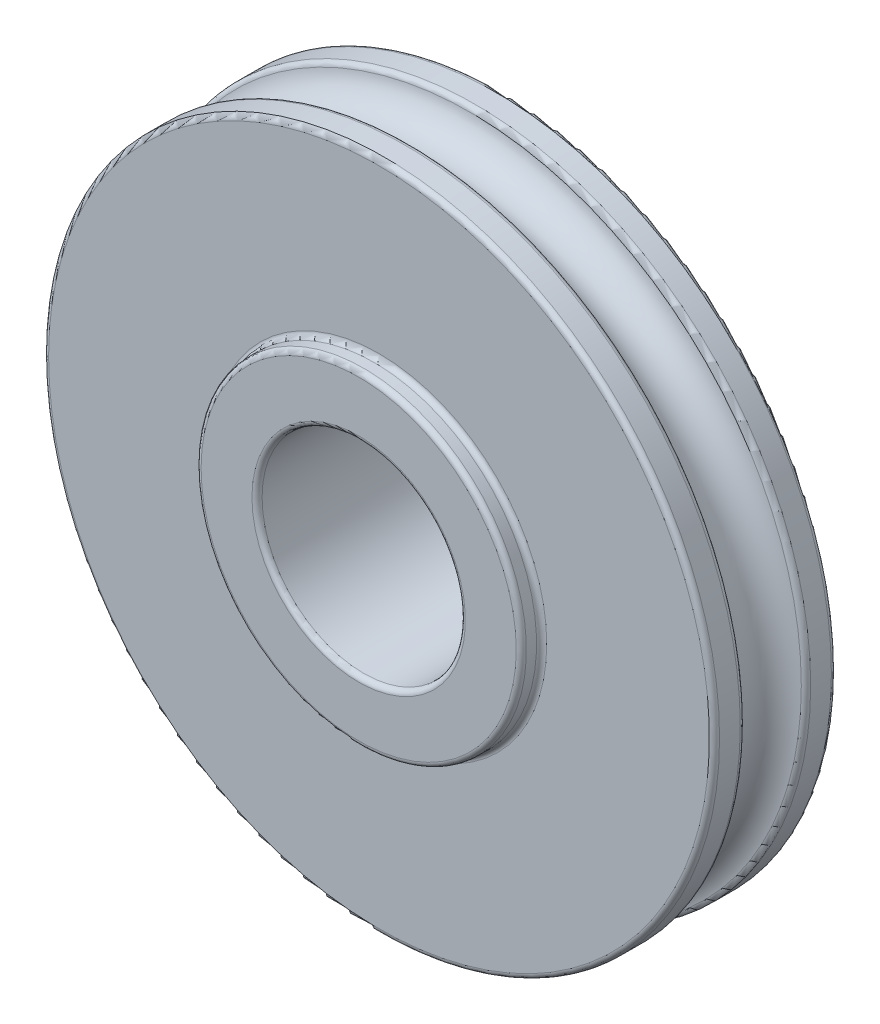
ISO-10303-21;
HEADER;
FILE_DESCRIPTION(('STEP AP214'),'2;1');
FILE_NAME('part.step','',(''),(''),'','','');
FILE_SCHEMA(('AUTOMOTIVE_DESIGN { 1 0 10303 214 1 1 1 1 }'));
ENDSEC;
DATA;
#1=APPLICATION_CONTEXT('core data for automotive mechanical design processes');
#2=APPLICATION_PROTOCOL_DEFINITION('international standard','automotive_design',2000,#1);
#3=PRODUCT_CONTEXT('',#1,'mechanical');
#4=PRODUCT('Part','Part','',(#3));
#5=PRODUCT_RELATED_PRODUCT_CATEGORY('part','',(#4));
#6=PRODUCT_DEFINITION_FORMATION('','',#4);
#7=PRODUCT_DEFINITION_CONTEXT('part definition',#1,'design');
#8=PRODUCT_DEFINITION('design','',#6,#7);
#9=PRODUCT_DEFINITION_SHAPE('','',#8);
#10=(LENGTH_UNIT() NAMED_UNIT(*) SI_UNIT(.MILLI.,.METRE.));
#11=(NAMED_UNIT(*) PLANE_ANGLE_UNIT() SI_UNIT($,.RADIAN.));
#12=(NAMED_UNIT(*) SI_UNIT($,.STERADIAN.) SOLID_ANGLE_UNIT());
#13=UNCERTAINTY_MEASURE_WITH_UNIT(LENGTH_MEASURE(1.E-05),#10,'distance_accuracy_value','');
#14=(GEOMETRIC_REPRESENTATION_CONTEXT(3) GLOBAL_UNCERTAINTY_ASSIGNED_CONTEXT((#13)) GLOBAL_UNIT_ASSIGNED_CONTEXT((#10,
#11,#12)) REPRESENTATION_CONTEXT('',''));
#15=CARTESIAN_POINT('',(0.,0.,0.));
#16=DIRECTION('',(0.,0.,1.));
#17=DIRECTION('',(1.,0.,0.));
#18=AXIS2_PLACEMENT_3D('',#15,#16,#17);
#19=CARTESIAN_POINT('',(0.,0.,0.));
#20=DIRECTION('',(0.,0.,1.));
#21=DIRECTION('',(1.,0.,0.));
#22=AXIS2_PLACEMENT_3D('',#19,#20,#21);
#23=TOROIDAL_SURFACE('',#22,16.5,1.5);
#24=CARTESIAN_POINT('',(0.,0.,-1.48461497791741));
#25=DIRECTION('',(0.,0.,1.));
#26=DIRECTION('',(1.,0.,0.));
#27=AXIS2_PLACEMENT_3D('',#24,#25,#26);
#28=CIRCLE('',#27,16.2857142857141);
#29=CARTESIAN_POINT('',(16.2857142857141,0.,-1.48461497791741));
#30=VERTEX_POINT('',#29);
#31=EDGE_CURVE('E67',#30,#30,#28,.T.);
#32=ORIENTED_EDGE('',*,*,#31,.T.);
#33=EDGE_LOOP('',(#32));
#34=FACE_BOUND('',#33,.T.);
#35=CARTESIAN_POINT('',(0.,0.,1.48461497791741));
#36=DIRECTION('',(0.,0.,-1.));
#37=DIRECTION('',(-1.,0.,0.));
#38=AXIS2_PLACEMENT_3D('',#35,#36,#37);
#39=CIRCLE('',#38,16.2857142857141);
#40=CARTESIAN_POINT('',(-16.2857142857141,0.,1.48461497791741));
#41=VERTEX_POINT('',#40);
#42=EDGE_CURVE('E70',#41,#41,#39,.T.);
#43=ORIENTED_EDGE('',*,*,#42,.T.);
#44=EDGE_LOOP('',(#43));
#45=FACE_BOUND('',#44,.T.);
#46=ADVANCED_FACE('F29',(#34,#45),#23,.F.);
#47=CARTESIAN_POINT('',(0.,0.,4.));
#48=DIRECTION('',(0.,0.,1.));
#49=DIRECTION('',(1.,0.,0.));
#50=AXIS2_PLACEMENT_3D('',#47,#48,#49);
#51=CYLINDRICAL_SURFACE('',#50,16.5);
#52=CARTESIAN_POINT('',(0.,0.,1.73205080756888));
#53=DIRECTION('',(0.,0.,-1.));
#54=DIRECTION('',(-1.,0.,0.));
#55=AXIS2_PLACEMENT_3D('',#52,#53,#54);
#56=CIRCLE('',#55,16.5);
#57=CARTESIAN_POINT('',(-16.5,0.,1.73205080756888));
#58=VERTEX_POINT('',#57);
#59=EDGE_CURVE('E61',#58,#58,#56,.F.);
#60=ORIENTED_EDGE('',*,*,#59,.T.);
#61=EDGE_LOOP('',(#60));
#62=FACE_BOUND('',#61,.T.);
#63=CARTESIAN_POINT('',(0.,0.,2.75));
#64=DIRECTION('',(0.,0.,-1.));
#65=DIRECTION('',(-1.,0.,0.));
#66=AXIS2_PLACEMENT_3D('',#63,#64,#65);
#67=CIRCLE('',#66,16.5);
#68=CARTESIAN_POINT('',(-16.5,0.,2.75));
#69=VERTEX_POINT('',#68);
#70=EDGE_CURVE('E64',#69,#69,#67,.T.);
#71=ORIENTED_EDGE('',*,*,#70,.T.);
#72=EDGE_LOOP('',(#71));
#73=FACE_BOUND('',#72,.T.);
#74=ADVANCED_FACE('F134',(#62,#73),#51,.T.);
#75=CARTESIAN_POINT('',(0.,16.5,3.));
#76=DIRECTION('',(0.,0.,-1.));
#77=DIRECTION('',(-1.,0.,0.));
#78=AXIS2_PLACEMENT_3D('',#75,#76,#77);
#79=PLANE('',#78);
#80=CARTESIAN_POINT('',(0.,0.,3.));
#81=DIRECTION('',(0.,0.,-1.));
#82=DIRECTION('',(-1.,0.,0.));
#83=AXIS2_PLACEMENT_3D('',#80,#81,#82);
#84=CIRCLE('',#83,16.25);
#85=CARTESIAN_POINT('',(-16.25,0.,3.));
#86=VERTEX_POINT('',#85);
#87=EDGE_CURVE('E55',#86,#86,#84,.F.);
#88=ORIENTED_EDGE('',*,*,#87,.T.);
#89=EDGE_LOOP('',(#88));
#90=FACE_BOUND('',#89,.T.);
#91=CARTESIAN_POINT('',(0.,0.,3.));
#92=DIRECTION('',(0.,0.,-1.));
#93=DIRECTION('',(-1.,0.,0.));
#94=AXIS2_PLACEMENT_3D('',#91,#92,#93);
#95=CIRCLE('',#94,8.25);
#96=CARTESIAN_POINT('',(-8.25,0.,3.));
#97=VERTEX_POINT('',#96);
#98=EDGE_CURVE('E58',#97,#97,#95,.T.);
#99=ORIENTED_EDGE('',*,*,#98,.T.);
#100=EDGE_LOOP('',(#99));
#101=FACE_BOUND('',#100,.T.);
#102=ADVANCED_FACE('F146',(#90,#101),#79,.F.);
#103=CARTESIAN_POINT('',(0.,0.,4.));
#104=DIRECTION('',(0.,0.,1.));
#105=DIRECTION('',(1.,0.,0.));
#106=AXIS2_PLACEMENT_3D('',#103,#104,#105);
#107=CYLINDRICAL_SURFACE('',#106,8.);
#108=CARTESIAN_POINT('',(0.,0.,3.25));
#109=DIRECTION('',(0.,0.,-1.));
#110=DIRECTION('',(-1.,0.,0.));
#111=AXIS2_PLACEMENT_3D('',#108,#109,#110);
#112=CIRCLE('',#111,8.);
#113=CARTESIAN_POINT('',(-8.,0.,3.25));
#114=VERTEX_POINT('',#113);
#115=EDGE_CURVE('E49',#114,#114,#112,.F.);
#116=ORIENTED_EDGE('',*,*,#115,.T.);
#117=EDGE_LOOP('',(#116));
#118=FACE_BOUND('',#117,.T.);
#119=CARTESIAN_POINT('',(0.,0.,3.75));
#120=DIRECTION('',(0.,0.,-1.));
#121=DIRECTION('',(-1.,0.,0.));
#122=AXIS2_PLACEMENT_3D('',#119,#120,#121);
#123=CIRCLE('',#122,8.);
#124=CARTESIAN_POINT('',(-8.,0.,3.75));
#125=VERTEX_POINT('',#124);
#126=EDGE_CURVE('E52',#125,#125,#123,.T.);
#127=ORIENTED_EDGE('',*,*,#126,.T.);
#128=EDGE_LOOP('',(#127));
#129=FACE_BOUND('',#128,.T.);
#130=ADVANCED_FACE('F158',(#118,#129),#107,.T.);
#131=CARTESIAN_POINT('',(0.,8.,4.));
#132=DIRECTION('',(0.,0.,-1.));
#133=DIRECTION('',(-1.,0.,0.));
#134=AXIS2_PLACEMENT_3D('',#131,#132,#133);
#135=PLANE('',#134);
#136=CARTESIAN_POINT('',(0.,0.,4.));
#137=DIRECTION('',(0.,0.,-1.));
#138=DIRECTION('',(-1.,0.,0.));
#139=AXIS2_PLACEMENT_3D('',#136,#137,#138);
#140=CIRCLE('',#139,7.75);
#141=CARTESIAN_POINT('',(-7.75,0.,4.));
#142=VERTEX_POINT('',#141);
#143=EDGE_CURVE('E40',#142,#142,#140,.F.);
#144=ORIENTED_EDGE('',*,*,#143,.T.);
#145=EDGE_LOOP('',(#144));
#146=FACE_BOUND('',#145,.T.);
#147=CARTESIAN_POINT('',(0.,0.,4.));
#148=DIRECTION('',(0.,0.,-1.));
#149=DIRECTION('',(-1.,0.,0.));
#150=AXIS2_PLACEMENT_3D('',#147,#148,#149);
#151=CIRCLE('',#150,5.25);
#152=CARTESIAN_POINT('',(-5.25,0.,4.));
#153=VERTEX_POINT('',#152);
#154=EDGE_CURVE('E44',#153,#153,#151,.T.);
#155=ORIENTED_EDGE('',*,*,#154,.T.);
#156=EDGE_LOOP('',(#155));
#157=FACE_BOUND('',#156,.T.);
#158=ADVANCED_FACE('F170',(#146,#157),#135,.F.);
#159=CARTESIAN_POINT('',(0.,0.,4.));
#160=DIRECTION('',(0.,0.,1.));
#161=DIRECTION('',(1.,0.,0.));
#162=AXIS2_PLACEMENT_3D('',#159,#160,#161);
#163=CYLINDRICAL_SURFACE('',#162,5.);
#164=CARTESIAN_POINT('',(0.,0.,3.75));
#165=DIRECTION('',(0.,0.,-1.));
#166=DIRECTION('',(-1.,0.,0.));
#167=AXIS2_PLACEMENT_3D('',#164,#165,#166);
#168=CIRCLE('',#167,5.);
#169=CARTESIAN_POINT('',(-5.,0.,3.75));
#170=VERTEX_POINT('',#169);
#171=EDGE_CURVE('E10',#170,#170,#168,.F.);
#172=ORIENTED_EDGE('',*,*,#171,.T.);
#173=EDGE_LOOP('',(#172));
#174=FACE_BOUND('',#173,.T.);
#175=CARTESIAN_POINT('',(0.,0.,-3.75));
#176=DIRECTION('',(0.,0.,1.));
#177=DIRECTION('',(1.,0.,0.));
#178=AXIS2_PLACEMENT_3D('',#175,#176,#177);
#179=CIRCLE('',#178,5.);
#180=CARTESIAN_POINT('',(5.,0.,-3.75));
#181=VERTEX_POINT('',#180);
#182=EDGE_CURVE('E36',#181,#181,#179,.F.);
#183=ORIENTED_EDGE('',*,*,#182,.T.);
#184=EDGE_LOOP('',(#183));
#185=FACE_BOUND('',#184,.T.);
#186=ADVANCED_FACE('F182',(#174,#185),#163,.F.);
#187=CARTESIAN_POINT('',(0.,5.,-4.));
#188=DIRECTION('',(0.,0.,1.));
#189=DIRECTION('',(1.,0.,0.));
#190=AXIS2_PLACEMENT_3D('',#187,#188,#189);
#191=PLANE('',#190);
#192=CARTESIAN_POINT('',(0.,0.,-4.));
#193=DIRECTION('',(0.,0.,1.));
#194=DIRECTION('',(1.,0.,0.));
#195=AXIS2_PLACEMENT_3D('',#192,#193,#194);
#196=CIRCLE('',#195,7.75);
#197=CARTESIAN_POINT('',(7.75,0.,-4.));
#198=VERTEX_POINT('',#197);
#199=EDGE_CURVE('E85',#198,#198,#196,.F.);
#200=ORIENTED_EDGE('',*,*,#199,.T.);
#201=EDGE_LOOP('',(#200));
#202=FACE_BOUND('',#201,.T.);
#203=CARTESIAN_POINT('',(0.,0.,-4.));
#204=DIRECTION('',(0.,0.,1.));
#205=DIRECTION('',(1.,0.,0.));
#206=AXIS2_PLACEMENT_3D('',#203,#204,#205);
#207=CIRCLE('',#206,5.25);
#208=CARTESIAN_POINT('',(5.25,0.,-4.));
#209=VERTEX_POINT('',#208);
#210=EDGE_CURVE('E88',#209,#209,#207,.T.);
#211=ORIENTED_EDGE('',*,*,#210,.T.);
#212=EDGE_LOOP('',(#211));
#213=FACE_BOUND('',#212,.T.);
#214=ADVANCED_FACE('F198',(#202,#213),#191,.F.);
#215=CARTESIAN_POINT('',(0.,0.,4.));
#216=DIRECTION('',(0.,0.,1.));
#217=DIRECTION('',(1.,0.,0.));
#218=AXIS2_PLACEMENT_3D('',#215,#216,#217);
#219=CYLINDRICAL_SURFACE('',#218,8.);
#220=CARTESIAN_POINT('',(0.,0.,-3.75));
#221=DIRECTION('',(0.,0.,1.));
#222=DIRECTION('',(1.,0.,0.));
#223=AXIS2_PLACEMENT_3D('',#220,#221,#222);
#224=CIRCLE('',#223,8.);
#225=CARTESIAN_POINT('',(8.,0.,-3.75));
#226=VERTEX_POINT('',#225);
#227=EDGE_CURVE('E91',#226,#226,#224,.T.);
#228=ORIENTED_EDGE('',*,*,#227,.T.);
#229=EDGE_LOOP('',(#228));
#230=FACE_BOUND('',#229,.T.);
#231=CARTESIAN_POINT('',(0.,0.,-3.25));
#232=DIRECTION('',(0.,0.,1.));
#233=DIRECTION('',(1.,0.,0.));
#234=AXIS2_PLACEMENT_3D('',#231,#232,#233);
#235=CIRCLE('',#234,8.);
#236=CARTESIAN_POINT('',(8.,0.,-3.25));
#237=VERTEX_POINT('',#236);
#238=EDGE_CURVE('E94',#237,#237,#235,.F.);
#239=ORIENTED_EDGE('',*,*,#238,.T.);
#240=EDGE_LOOP('',(#239));
#241=FACE_BOUND('',#240,.T.);
#242=ADVANCED_FACE('F98',(#230,#241),#219,.T.);
#243=CARTESIAN_POINT('',(0.,8.,-3.));
#244=DIRECTION('',(0.,0.,1.));
#245=DIRECTION('',(1.,0.,0.));
#246=AXIS2_PLACEMENT_3D('',#243,#244,#245);
#247=PLANE('',#246);
#248=CARTESIAN_POINT('',(0.,0.,-3.));
#249=DIRECTION('',(0.,0.,1.));
#250=DIRECTION('',(1.,0.,0.));
#251=AXIS2_PLACEMENT_3D('',#248,#249,#250);
#252=CIRCLE('',#251,8.25);
#253=CARTESIAN_POINT('',(8.25,0.,-3.));
#254=VERTEX_POINT('',#253);
#255=EDGE_CURVE('E79',#254,#254,#252,.T.);
#256=ORIENTED_EDGE('',*,*,#255,.T.);
#257=EDGE_LOOP('',(#256));
#258=FACE_BOUND('',#257,.T.);
#259=CARTESIAN_POINT('',(0.,0.,-3.));
#260=DIRECTION('',(0.,0.,1.));
#261=DIRECTION('',(1.,0.,0.));
#262=AXIS2_PLACEMENT_3D('',#259,#260,#261);
#263=CIRCLE('',#262,16.25);
#264=CARTESIAN_POINT('',(16.25,0.,-3.));
#265=VERTEX_POINT('',#264);
#266=EDGE_CURVE('E82',#265,#265,#263,.F.);
#267=ORIENTED_EDGE('',*,*,#266,.T.);
#268=EDGE_LOOP('',(#267));
#269=FACE_BOUND('',#268,.T.);
#270=ADVANCED_FACE('F108',(#258,#269),#247,.F.);
#271=CARTESIAN_POINT('',(0.,0.,4.));
#272=DIRECTION('',(0.,0.,1.));
#273=DIRECTION('',(1.,0.,0.));
#274=AXIS2_PLACEMENT_3D('',#271,#272,#273);
#275=CYLINDRICAL_SURFACE('',#274,16.5);
#276=CARTESIAN_POINT('',(0.,0.,-2.75));
#277=DIRECTION('',(0.,0.,1.));
#278=DIRECTION('',(1.,0.,0.));
#279=AXIS2_PLACEMENT_3D('',#276,#277,#278);
#280=CIRCLE('',#279,16.5);
#281=CARTESIAN_POINT('',(16.5,0.,-2.75));
#282=VERTEX_POINT('',#281);
#283=EDGE_CURVE('E73',#282,#282,#280,.T.);
#284=ORIENTED_EDGE('',*,*,#283,.T.);
#285=EDGE_LOOP('',(#284));
#286=FACE_BOUND('',#285,.T.);
#287=CARTESIAN_POINT('',(0.,0.,-1.73205080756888));
#288=DIRECTION('',(0.,0.,-1.));
#289=DIRECTION('',(-1.,0.,0.));
#290=AXIS2_PLACEMENT_3D('',#287,#288,#289);
#291=CIRCLE('',#290,16.5);
#292=CARTESIAN_POINT('',(-16.5,0.,-1.73205080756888));
#293=VERTEX_POINT('',#292);
#294=EDGE_CURVE('E76',#293,#293,#291,.T.);
#295=ORIENTED_EDGE('',*,*,#294,.T.);
#296=EDGE_LOOP('',(#295));
#297=FACE_BOUND('',#296,.T.);
#298=ADVANCED_FACE('F111',(#286,#297),#275,.T.);
#299=CARTESIAN_POINT('',(0.,0.,-3.75));
#300=DIRECTION('',(0.,0.,1.));
#301=DIRECTION('',(1.,0.,0.));
#302=AXIS2_PLACEMENT_3D('',#299,#300,#301);
#303=TOROIDAL_SURFACE('',#302,7.75,0.25);
#304=ORIENTED_EDGE('',*,*,#199,.F.);
#305=EDGE_LOOP('',(#304));
#306=FACE_BOUND('',#305,.T.);
#307=ORIENTED_EDGE('',*,*,#227,.F.);
#308=EDGE_LOOP('',(#307));
#309=FACE_BOUND('',#308,.T.);
#310=ADVANCED_FACE('F104',(#306,#309),#303,.T.);
#311=CARTESIAN_POINT('',(0.,0.,-3.25));
#312=DIRECTION('',(0.,0.,1.));
#313=DIRECTION('',(1.,0.,0.));
#314=AXIS2_PLACEMENT_3D('',#311,#312,#313);
#315=TOROIDAL_SURFACE('',#314,8.25,0.25);
#316=ORIENTED_EDGE('',*,*,#238,.F.);
#317=EDGE_LOOP('',(#316));
#318=FACE_BOUND('',#317,.T.);
#319=ORIENTED_EDGE('',*,*,#255,.F.);
#320=EDGE_LOOP('',(#319));
#321=FACE_BOUND('',#320,.T.);
#322=ADVANCED_FACE('F100',(#318,#321),#315,.F.);
#323=CARTESIAN_POINT('',(0.,0.,-2.75));
#324=DIRECTION('',(0.,0.,1.));
#325=DIRECTION('',(1.,0.,0.));
#326=AXIS2_PLACEMENT_3D('',#323,#324,#325);
#327=TOROIDAL_SURFACE('',#326,16.25,0.25);
#328=ORIENTED_EDGE('',*,*,#266,.F.);
#329=EDGE_LOOP('',(#328));
#330=FACE_BOUND('',#329,.T.);
#331=ORIENTED_EDGE('',*,*,#283,.F.);
#332=EDGE_LOOP('',(#331));
#333=FACE_BOUND('',#332,.T.);
#334=ADVANCED_FACE('F103',(#330,#333),#327,.T.);
#335=CARTESIAN_POINT('',(0.,0.,-1.73205080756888));
#336=DIRECTION('',(0.,0.,-1.));
#337=DIRECTION('',(-1.,0.,0.));
#338=AXIS2_PLACEMENT_3D('',#335,#336,#337);
#339=TOROIDAL_SURFACE('',#338,16.25,0.25);
#340=ORIENTED_EDGE('',*,*,#294,.F.);
#341=EDGE_LOOP('',(#340));
#342=FACE_BOUND('',#341,.T.);
#343=ORIENTED_EDGE('',*,*,#31,.F.);
#344=EDGE_LOOP('',(#343));
#345=FACE_BOUND('',#344,.T.);
#346=ADVANCED_FACE('F117',(#342,#345),#339,.T.);
#347=CARTESIAN_POINT('',(0.,0.,1.73205080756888));
#348=DIRECTION('',(0.,0.,-1.));
#349=DIRECTION('',(-1.,0.,0.));
#350=AXIS2_PLACEMENT_3D('',#347,#348,#349);
#351=TOROIDAL_SURFACE('',#350,16.25,0.25);
#352=ORIENTED_EDGE('',*,*,#42,.F.);
#353=EDGE_LOOP('',(#352));
#354=FACE_BOUND('',#353,.T.);
#355=ORIENTED_EDGE('',*,*,#59,.F.);
#356=EDGE_LOOP('',(#355));
#357=FACE_BOUND('',#356,.T.);
#358=ADVANCED_FACE('F128',(#354,#357),#351,.T.);
#359=CARTESIAN_POINT('',(0.,0.,2.75));
#360=DIRECTION('',(0.,0.,-1.));
#361=DIRECTION('',(-1.,0.,0.));
#362=AXIS2_PLACEMENT_3D('',#359,#360,#361);
#363=TOROIDAL_SURFACE('',#362,16.25,0.25);
#364=ORIENTED_EDGE('',*,*,#70,.F.);
#365=EDGE_LOOP('',(#364));
#366=FACE_BOUND('',#365,.T.);
#367=ORIENTED_EDGE('',*,*,#87,.F.);
#368=EDGE_LOOP('',(#367));
#369=FACE_BOUND('',#368,.T.);
#370=ADVANCED_FACE('F140',(#366,#369),#363,.T.);
#371=CARTESIAN_POINT('',(0.,0.,3.25));
#372=DIRECTION('',(0.,0.,-1.));
#373=DIRECTION('',(-1.,0.,0.));
#374=AXIS2_PLACEMENT_3D('',#371,#372,#373);
#375=TOROIDAL_SURFACE('',#374,8.25,0.25);
#376=ORIENTED_EDGE('',*,*,#98,.F.);
#377=EDGE_LOOP('',(#376));
#378=FACE_BOUND('',#377,.T.);
#379=ORIENTED_EDGE('',*,*,#115,.F.);
#380=EDGE_LOOP('',(#379));
#381=FACE_BOUND('',#380,.T.);
#382=ADVANCED_FACE('F152',(#378,#381),#375,.F.);
#383=CARTESIAN_POINT('',(0.,0.,3.75));
#384=DIRECTION('',(0.,0.,-1.));
#385=DIRECTION('',(-1.,0.,0.));
#386=AXIS2_PLACEMENT_3D('',#383,#384,#385);
#387=TOROIDAL_SURFACE('',#386,7.75,0.25);
#388=ORIENTED_EDGE('',*,*,#126,.F.);
#389=EDGE_LOOP('',(#388));
#390=FACE_BOUND('',#389,.T.);
#391=ORIENTED_EDGE('',*,*,#143,.F.);
#392=EDGE_LOOP('',(#391));
#393=FACE_BOUND('',#392,.T.);
#394=ADVANCED_FACE('F164',(#390,#393),#387,.T.);
#395=CARTESIAN_POINT('',(0.,0.,3.75));
#396=DIRECTION('',(0.,0.,-1.));
#397=DIRECTION('',(-1.,0.,0.));
#398=AXIS2_PLACEMENT_3D('',#395,#396,#397);
#399=TOROIDAL_SURFACE('',#398,5.25,0.25);
#400=ORIENTED_EDGE('',*,*,#154,.F.);
#401=EDGE_LOOP('',(#400));
#402=FACE_BOUND('',#401,.T.);
#403=ORIENTED_EDGE('',*,*,#171,.F.);
#404=EDGE_LOOP('',(#403));
#405=FACE_BOUND('',#404,.T.);
#406=ADVANCED_FACE('F176',(#402,#405),#399,.T.);
#407=CARTESIAN_POINT('',(0.,0.,-3.75));
#408=DIRECTION('',(0.,0.,1.));
#409=DIRECTION('',(1.,0.,0.));
#410=AXIS2_PLACEMENT_3D('',#407,#408,#409);
#411=TOROIDAL_SURFACE('',#410,5.25,0.25);
#412=ORIENTED_EDGE('',*,*,#182,.F.);
#413=EDGE_LOOP('',(#412));
#414=FACE_BOUND('',#413,.T.);
#415=ORIENTED_EDGE('',*,*,#210,.F.);
#416=EDGE_LOOP('',(#415));
#417=FACE_BOUND('',#416,.T.);
#418=ADVANCED_FACE('F31',(#414,#417),#411,.T.);
#419=CLOSED_SHELL('',(#46,#74,#102,#130,#158,#186,#214,#242,#270,#298,#310,#322,#334,#346,#358,
#370,#382,#394,#406,#418));
#420=MANIFOLD_SOLID_BREP('B2',#419);
#421=ADVANCED_BREP_SHAPE_REPRESENTATION('',(#18,#420),#14);
#422=SHAPE_DEFINITION_REPRESENTATION(#9,#421);
ENDSEC;
END-ISO-10303-21;
